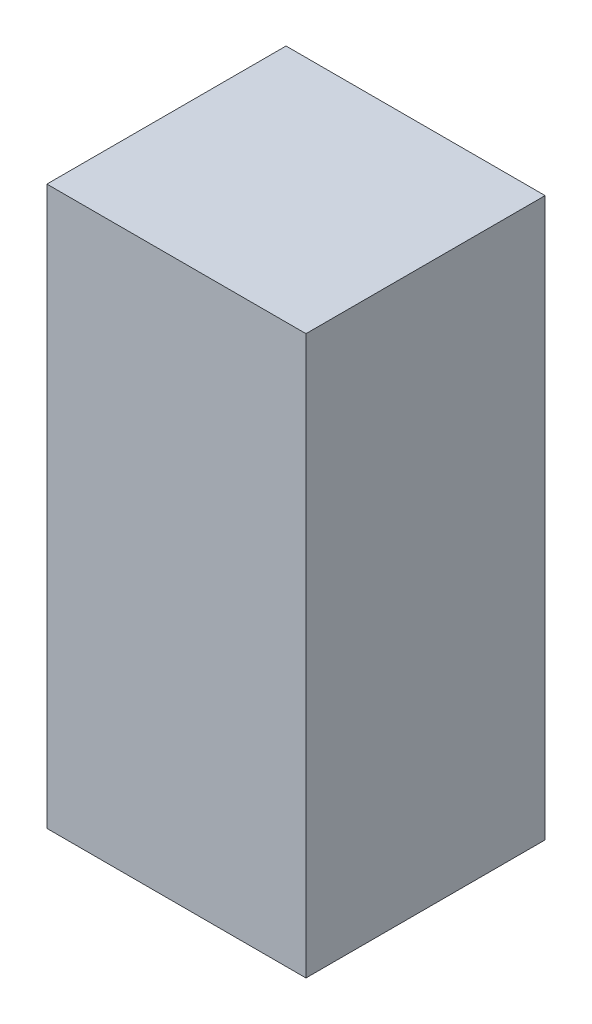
ISO-10303-21;
HEADER;
FILE_DESCRIPTION(('STEP AP214'),'2;1');
FILE_NAME('part.step','',(''),(''),'','','');
FILE_SCHEMA(('AUTOMOTIVE_DESIGN { 1 0 10303 214 1 1 1 1 }'));
ENDSEC;
DATA;
#1=APPLICATION_CONTEXT('core data for automotive mechanical design processes');
#2=APPLICATION_PROTOCOL_DEFINITION('international standard','automotive_design',2000,#1);
#3=PRODUCT_CONTEXT('',#1,'mechanical');
#4=PRODUCT('Part','Part','',(#3));
#5=PRODUCT_RELATED_PRODUCT_CATEGORY('part','',(#4));
#6=PRODUCT_DEFINITION_FORMATION('','',#4);
#7=PRODUCT_DEFINITION_CONTEXT('part definition',#1,'design');
#8=PRODUCT_DEFINITION('design','',#6,#7);
#9=PRODUCT_DEFINITION_SHAPE('','',#8);
#10=(LENGTH_UNIT() NAMED_UNIT(*) SI_UNIT(.MILLI.,.METRE.));
#11=(NAMED_UNIT(*) PLANE_ANGLE_UNIT() SI_UNIT($,.RADIAN.));
#12=(NAMED_UNIT(*) SI_UNIT($,.STERADIAN.) SOLID_ANGLE_UNIT());
#13=UNCERTAINTY_MEASURE_WITH_UNIT(LENGTH_MEASURE(1.E-05),#10,'distance_accuracy_value','');
#14=(GEOMETRIC_REPRESENTATION_CONTEXT(3) GLOBAL_UNCERTAINTY_ASSIGNED_CONTEXT((#13)) GLOBAL_UNIT_ASSIGNED_CONTEXT((#10,
#11,#12)) REPRESENTATION_CONTEXT('',''));
#15=CARTESIAN_POINT('',(0.,0.,0.));
#16=DIRECTION('',(0.,0.,1.));
#17=DIRECTION('',(1.,0.,0.));
#18=AXIS2_PLACEMENT_3D('',#15,#16,#17);
#19=CARTESIAN_POINT('',(8.69999999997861,20.8639846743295,-18.1901383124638));
#20=DIRECTION('',(-1.,0.,0.));
#21=DIRECTION('',(0.,0.,1.));
#22=AXIS2_PLACEMENT_3D('',#19,#20,#21);
#23=PLANE('',#22);
#24=DIRECTION('',(0.,1.,0.));
#25=VECTOR('',#24,1.);
#26=CARTESIAN_POINT('',(8.69999999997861,20.8639846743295,-2.75478927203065));
#27=LINE('',#26,#25);
#28=CARTESIAN_POINT('',(8.69999999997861,6.86398467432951,-2.75478927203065));
#29=VERTEX_POINT('',#28);
#30=CARTESIAN_POINT('',(8.69999999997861,20.8639846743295,-2.75478927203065));
#31=VERTEX_POINT('',#30);
#32=EDGE_CURVE('E36',#29,#31,#27,.T.);
#33=ORIENTED_EDGE('',*,*,#32,.F.);
#34=DIRECTION('',(0.,0.,1.));
#35=VECTOR('',#34,1.);
#36=CARTESIAN_POINT('',(8.69999999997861,6.86398467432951,-18.1901383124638));
#37=LINE('',#36,#35);
#38=CARTESIAN_POINT('',(8.69999999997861,6.86398467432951,3.24521072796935));
#39=VERTEX_POINT('',#38);
#40=EDGE_CURVE('E97',#29,#39,#37,.T.);
#41=ORIENTED_EDGE('',*,*,#40,.T.);
#42=DIRECTION('',(0.,1.,0.));
#43=VECTOR('',#42,1.);
#44=CARTESIAN_POINT('',(8.69999999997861,20.8639846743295,3.24521072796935));
#45=LINE('',#44,#43);
#46=CARTESIAN_POINT('',(8.69999999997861,20.8639846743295,3.24521072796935));
#47=VERTEX_POINT('',#46);
#48=EDGE_CURVE('E90',#39,#47,#45,.T.);
#49=ORIENTED_EDGE('',*,*,#48,.T.);
#50=DIRECTION('',(0.,0.,1.));
#51=VECTOR('',#50,1.);
#52=CARTESIAN_POINT('',(8.69999999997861,20.8639846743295,-18.1901383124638));
#53=LINE('',#52,#51);
#54=EDGE_CURVE('E72',#31,#47,#53,.T.);
#55=ORIENTED_EDGE('',*,*,#54,.F.);
#56=EDGE_LOOP('',(#33,#41,#49,#55));
#57=FACE_BOUND('',#56,.T.);
#58=ADVANCED_FACE('F28',(#57),#23,.T.);
#59=CARTESIAN_POINT('',(8.69999999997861,20.8639846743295,-18.1901383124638));
#60=DIRECTION('',(0.,1.,0.));
#61=DIRECTION('',(0.,0.,1.));
#62=AXIS2_PLACEMENT_3D('',#59,#60,#61);
#63=PLANE('',#62);
#64=DIRECTION('',(1.,0.,0.));
#65=VECTOR('',#64,1.);
#66=CARTESIAN_POINT('',(8.69999999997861,20.8639846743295,-2.75478927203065));
#67=LINE('',#66,#65);
#68=CARTESIAN_POINT('',(15.1999999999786,20.8639846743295,-2.75478927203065));
#69=VERTEX_POINT('',#68);
#70=EDGE_CURVE('E93',#31,#69,#67,.T.);
#71=ORIENTED_EDGE('',*,*,#70,.F.);
#72=ORIENTED_EDGE('',*,*,#54,.T.);
#73=DIRECTION('',(1.,0.,0.));
#74=VECTOR('',#73,1.);
#75=CARTESIAN_POINT('',(8.69999999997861,20.8639846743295,3.24521072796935));
#76=LINE('',#75,#74);
#77=CARTESIAN_POINT('',(15.1999999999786,20.8639846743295,3.24521072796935));
#78=VERTEX_POINT('',#77);
#79=EDGE_CURVE('E80',#47,#78,#76,.T.);
#80=ORIENTED_EDGE('',*,*,#79,.T.);
#81=DIRECTION('',(0.,0.,1.));
#82=VECTOR('',#81,1.);
#83=CARTESIAN_POINT('',(15.1999999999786,20.8639846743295,-18.1901383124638));
#84=LINE('',#83,#82);
#85=EDGE_CURVE('E63',#69,#78,#84,.T.);
#86=ORIENTED_EDGE('',*,*,#85,.F.);
#87=EDGE_LOOP('',(#71,#72,#80,#86));
#88=FACE_BOUND('',#87,.T.);
#89=ADVANCED_FACE('F85',(#88),#63,.T.);
#90=CARTESIAN_POINT('',(15.1999999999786,20.8639846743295,-18.1901383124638));
#91=DIRECTION('',(1.,0.,0.));
#92=DIRECTION('',(0.,0.,-1.));
#93=AXIS2_PLACEMENT_3D('',#90,#91,#92);
#94=PLANE('',#93);
#95=DIRECTION('',(0.,-1.,0.));
#96=VECTOR('',#95,1.);
#97=CARTESIAN_POINT('',(15.1999999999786,20.8639846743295,-2.75478927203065));
#98=LINE('',#97,#96);
#99=CARTESIAN_POINT('',(15.1999999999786,6.86398467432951,-2.75478927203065));
#100=VERTEX_POINT('',#99);
#101=EDGE_CURVE('E68',#69,#100,#98,.T.);
#102=ORIENTED_EDGE('',*,*,#101,.F.);
#103=ORIENTED_EDGE('',*,*,#85,.T.);
#104=DIRECTION('',(0.,-1.,0.));
#105=VECTOR('',#104,1.);
#106=CARTESIAN_POINT('',(15.1999999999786,20.8639846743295,3.24521072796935));
#107=LINE('',#106,#105);
#108=CARTESIAN_POINT('',(15.1999999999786,6.86398467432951,3.24521072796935));
#109=VERTEX_POINT('',#108);
#110=EDGE_CURVE('E67',#78,#109,#107,.T.);
#111=ORIENTED_EDGE('',*,*,#110,.T.);
#112=DIRECTION('',(0.,0.,1.));
#113=VECTOR('',#112,1.);
#114=CARTESIAN_POINT('',(15.1999999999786,6.86398467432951,-18.1901383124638));
#115=LINE('',#114,#113);
#116=EDGE_CURVE('E73',#100,#109,#115,.T.);
#117=ORIENTED_EDGE('',*,*,#116,.F.);
#118=EDGE_LOOP('',(#102,#103,#111,#117));
#119=FACE_BOUND('',#118,.T.);
#120=ADVANCED_FACE('F65',(#119),#94,.T.);
#121=CARTESIAN_POINT('',(8.69999999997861,6.86398467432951,-18.1901383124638));
#122=DIRECTION('',(0.,-1.,0.));
#123=DIRECTION('',(0.,0.,-1.));
#124=AXIS2_PLACEMENT_3D('',#121,#122,#123);
#125=PLANE('',#124);
#126=DIRECTION('',(-1.,0.,0.));
#127=VECTOR('',#126,1.);
#128=CARTESIAN_POINT('',(8.69999999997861,6.86398467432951,-2.75478927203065));
#129=LINE('',#128,#127);
#130=EDGE_CURVE('E11',#100,#29,#129,.T.);
#131=ORIENTED_EDGE('',*,*,#130,.F.);
#132=ORIENTED_EDGE('',*,*,#116,.T.);
#133=DIRECTION('',(-1.,0.,0.));
#134=VECTOR('',#133,1.);
#135=CARTESIAN_POINT('',(8.69999999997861,6.86398467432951,3.24521072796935));
#136=LINE('',#135,#134);
#137=EDGE_CURVE('E83',#109,#39,#136,.T.);
#138=ORIENTED_EDGE('',*,*,#137,.T.);
#139=ORIENTED_EDGE('',*,*,#40,.F.);
#140=EDGE_LOOP('',(#131,#132,#138,#139));
#141=FACE_BOUND('',#140,.T.);
#142=ADVANCED_FACE('F101',(#141),#125,.T.);
#143=CARTESIAN_POINT('',(8.69999999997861,29.3639846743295,-2.75478927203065));
#144=DIRECTION('',(0.,0.,1.));
#145=DIRECTION('',(0.999999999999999,0.,0.));
#146=AXIS2_PLACEMENT_3D('',#143,#144,#145);
#147=PLANE('',#146);
#148=ORIENTED_EDGE('',*,*,#32,.T.);
#149=ORIENTED_EDGE('',*,*,#70,.T.);
#150=ORIENTED_EDGE('',*,*,#101,.T.);
#151=ORIENTED_EDGE('',*,*,#130,.T.);
#152=EDGE_LOOP('',(#148,#149,#150,#151));
#153=FACE_BOUND('',#152,.T.);
#154=ADVANCED_FACE('F103',(#153),#147,.F.);
#155=CARTESIAN_POINT('',(15.1999999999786,29.3639846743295,3.24521072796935));
#156=DIRECTION('',(0.,0.,-1.));
#157=DIRECTION('',(-1.,0.,0.));
#158=AXIS2_PLACEMENT_3D('',#155,#156,#157);
#159=PLANE('',#158);
#160=ORIENTED_EDGE('',*,*,#137,.F.);
#161=ORIENTED_EDGE('',*,*,#110,.F.);
#162=ORIENTED_EDGE('',*,*,#79,.F.);
#163=ORIENTED_EDGE('',*,*,#48,.F.);
#164=EDGE_LOOP('',(#160,#161,#162,#163));
#165=FACE_BOUND('',#164,.T.);
#166=ADVANCED_FACE('F78',(#165),#159,.F.);
#167=CLOSED_SHELL('',(#58,#89,#120,#142,#154,#166));
#168=MANIFOLD_SOLID_BREP('B2',#167);
#169=ADVANCED_BREP_SHAPE_REPRESENTATION('',(#18,#168),#14);
#170=SHAPE_DEFINITION_REPRESENTATION(#9,#169);
ENDSEC;
END-ISO-10303-21;
